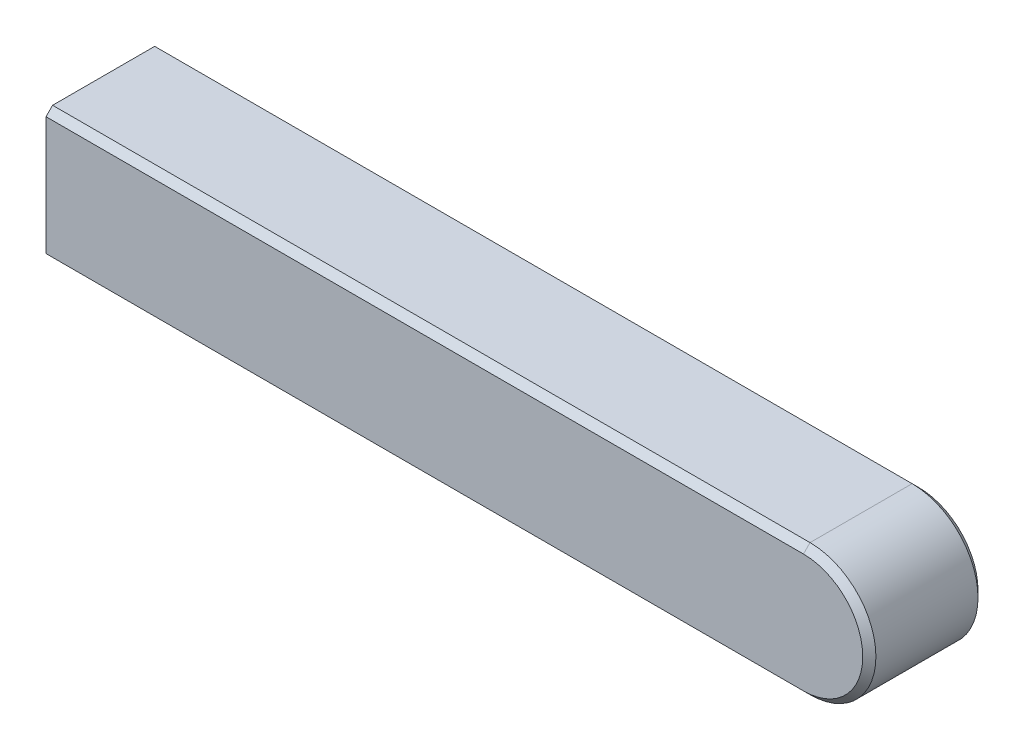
from build123d import *

# Parameters (mm, degrees)
EXTRUDE1_DEPTH = 7
CHAMFER1_SIZE  = 0.4


with BuildPart() as part:
    # body → Extrude1 (new body)
    with BuildSketch(Plane.XY):
        with BuildLine():
            Line((0, 0), (46, 0))
            ThreePointArc((46, 0), (50, 4), (46, 8))
            Line((46, 8), (0, 8))
            Line((0, 8), (0, 0))
        make_face()
    extrude(amount=EXTRUDE1_DEPTH)

    # Chamfer1
    chamfer1_edges = [part.edges().sort_by_distance(p)[0] for p in [
        (50, 4, 7),
        (23, 8, 7),
        (23, 8, 0),
        (50, 4, 0),
        (23, 0, 0),
        (23, 0, 7),
    ]]
    chamfer(chamfer1_edges, length=CHAMFER1_SIZE)


solid = part.part
